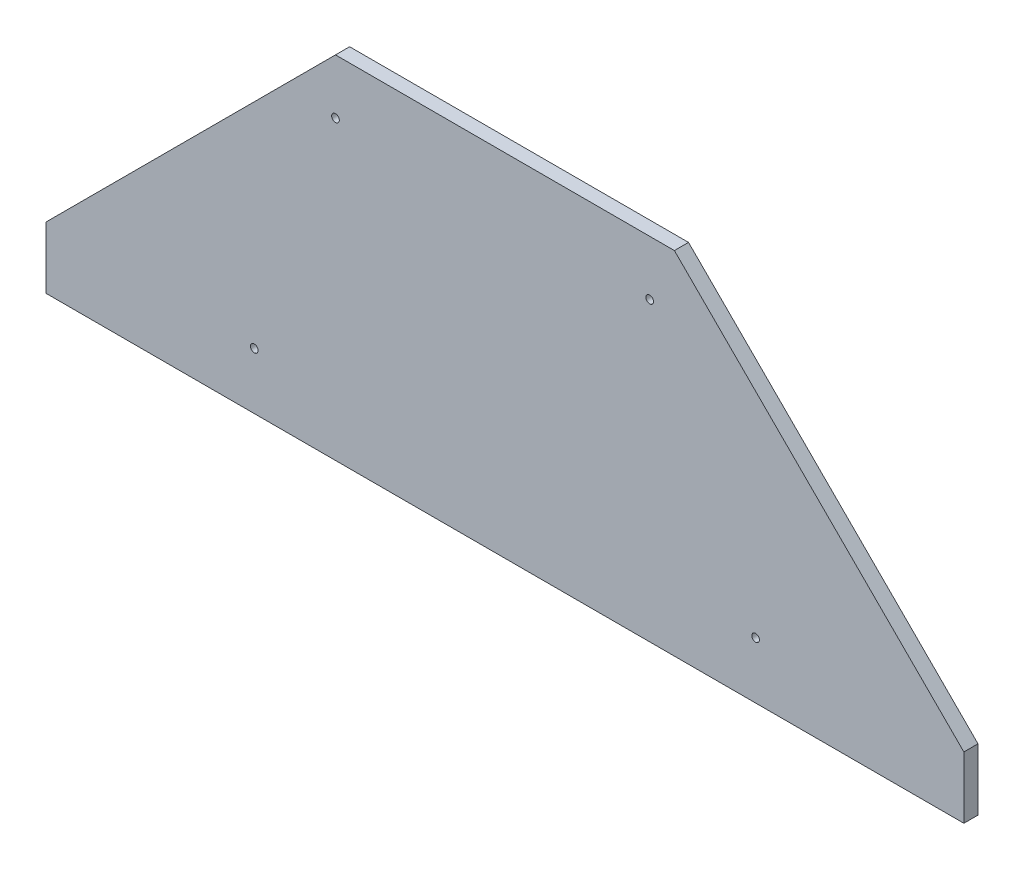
from build123d import *

# Parameters (mm, degrees)
SKETCH1_R      = 3.429
EXTRUDE1_DEPTH = 6.35


with BuildPart() as part:
    # Sketch1 → Extrude1 (new, symmetric)
    with BuildSketch(Plane.XY):
        Polygon((412.75, -102.39375), (152.4, 157.95625), (-152.4, 157.95625), (-412.75, -102.39375), (-412.75, -157.95625), (412.75, -157.95625), align=None)
        with Locations((-225.425, -107.15625)):
            Circle(SKETCH1_R, mode=Mode.SUBTRACT)
        with Locations((225.425, -107.15625)):
            Circle(SKETCH1_R, mode=Mode.SUBTRACT)
        with Locations((-152.4, 108.74375)):
            Circle(SKETCH1_R, mode=Mode.SUBTRACT)
        with Locations((130.175, 108.74375)):
            Circle(SKETCH1_R, mode=Mode.SUBTRACT)
    extrude(amount=EXTRUDE1_DEPTH, both=True)


solid = part.part
